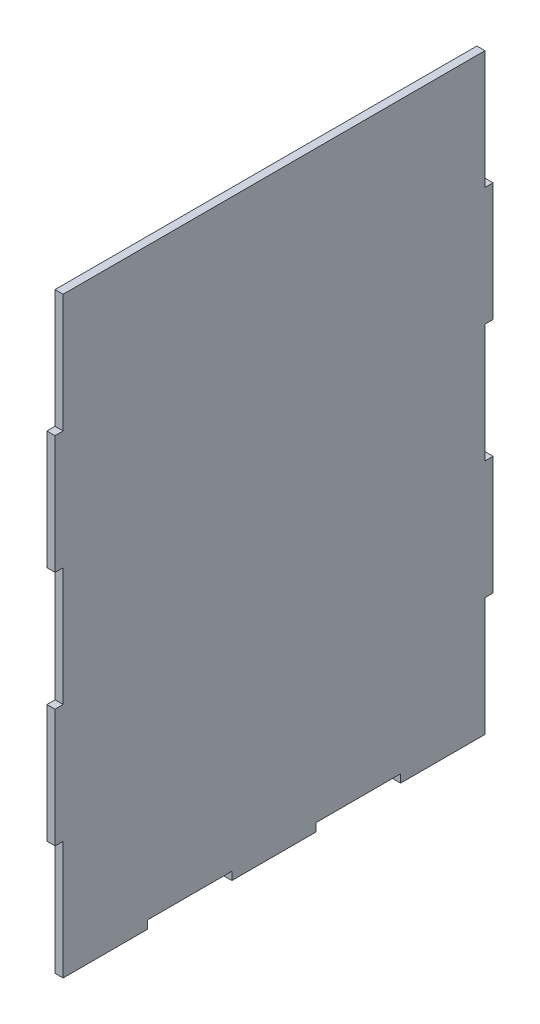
from build123d import *

# Parameters (mm, degrees)
BOSS_EXTRUDE1_DEPTH = 3.175


with BuildPart() as part:
    # Sketch1 → Boss-Extrude1 (new body)
    with BuildSketch(Plane(origin=(3.175, 0, 0), x_dir=(0, 0, -1), z_dir=(1, 0, 0))):
        Polygon((168.275, -46.355), (168.275, 0), (3.175, 0), (3.175, -46.355), (0, -46.355), (0, -92.71), (3.175, -92.71), (3.175, -139.065), (0, -139.065), (0, -185.42), (3.175, -185.42), (3.175, -231.775), (36.195, -231.775), (36.195, -228.6), (69.215, -228.6), (69.215, -231.775), (102.235, -231.775), (102.235, -228.6), (135.255, -228.6), (135.255, -231.775), (168.275, -231.775), (168.275, -185.42), (171.45, -185.42), (171.45, -139.065), (168.275, -139.065), (168.275, -92.71), (171.45, -92.71), (171.45, -46.355), align=None)
    extrude(amount=-BOSS_EXTRUDE1_DEPTH)


solid = part.part
